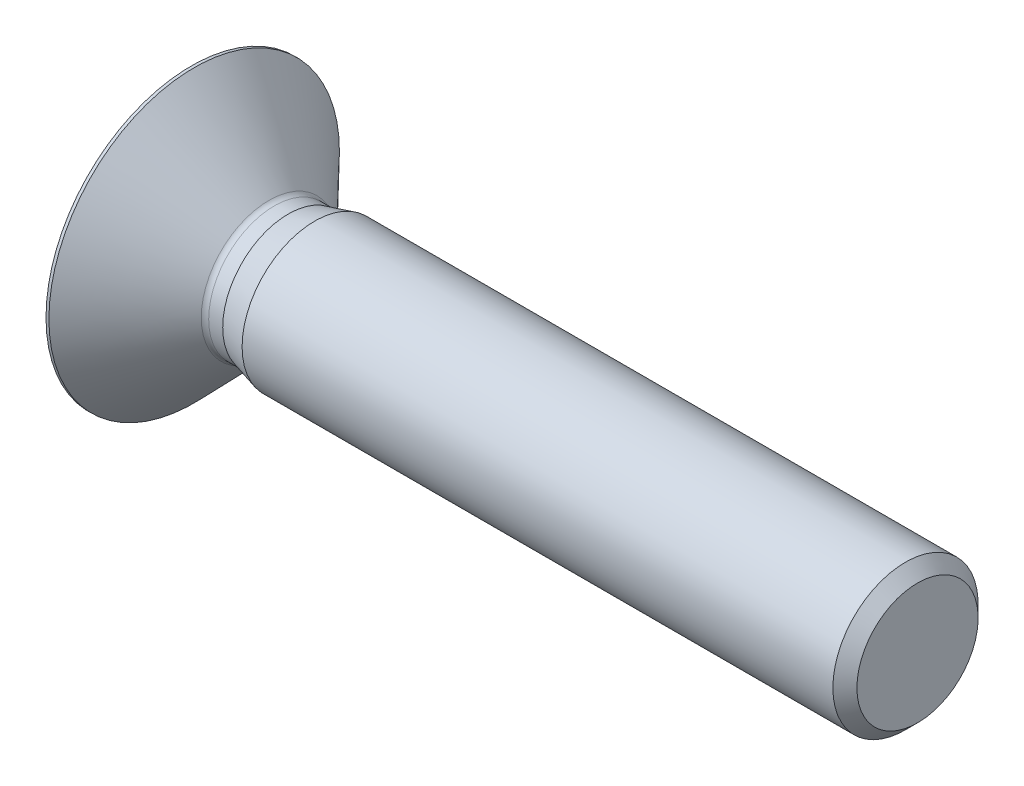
from build123d import *

# Parameters (mm, degrees)
FILLET1_R   = 0.5
HEX_2_DEPTH = 4.4


with BuildPart() as part:
    # BodySke → BaseBody (revolve)
    with BuildSketch(Plane.XY, mode=Mode.PRIVATE) as basebody_sk:
        Polygon((0, 0), (0, 10), (0.2, 10), (5.5, 4.511689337), (6.677599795, 4.511689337), (8.5, 5), (49.172, 5), (50, 4.172), (50, 0), align=None)
    revolve(basebody_sk.sketch.rotate(Axis((0, 0, 0), (1, 0, 0)), 90), axis=Axis((0, 0, 0), (1, 0, 0)))

    # Fillet1
    fillet1_edges = [part.edges().sort_by_distance(p)[0] for p in [
        (5.5, 0, -4.511689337),
    ]]
    fillet(fillet1_edges, radius=FILLET1_R)

    # HexSke → Hex 2 (cut)
    with BuildSketch(Plane(origin=(0, 0, 0), x_dir=(0, 0, -1), z_dir=(1, 0, 0))):
        Polygon((0, 3.464101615), (-3, 1.732050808), (-3, -1.732050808), (0, -3.464101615), (3, -1.732050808), (3, 1.732050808), align=None)
    extrude(amount=HEX_2_DEPTH, mode=Mode.SUBTRACT)

    # Hex-PreBroachSke → Hex-PreBroach (revolve, cut)
    with BuildSketch(Plane.XY, mode=Mode.PRIVATE) as hex_prebroach_sk:
        Polygon((0, 0), (0, 3), (4.4, 3), (6.132050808, 0), align=None)
    revolve(hex_prebroach_sk.sketch.rotate(Axis((0, 0, 0), (1, 0, 0)), 90), axis=Axis((0, 0, 0), (1, 0, 0)), mode=Mode.SUBTRACT)


solid = part.part
